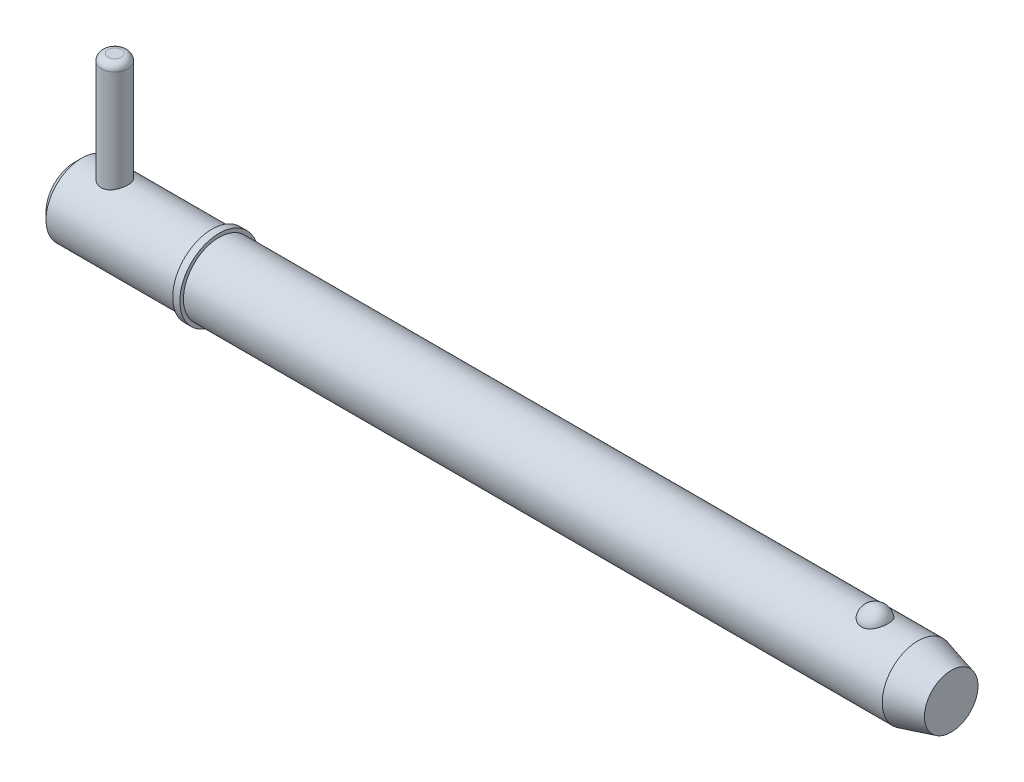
ISO-10303-21;
HEADER;
FILE_DESCRIPTION(('STEP AP214'),'2;1');
FILE_NAME('part.step','',(''),(''),'','','');
FILE_SCHEMA(('AUTOMOTIVE_DESIGN { 1 0 10303 214 1 1 1 1 }'));
ENDSEC;
DATA;
#1=APPLICATION_CONTEXT('core data for automotive mechanical design processes');
#2=APPLICATION_PROTOCOL_DEFINITION('international standard','automotive_design',2000,#1);
#3=PRODUCT_CONTEXT('',#1,'mechanical');
#4=PRODUCT('Part','Part','',(#3));
#5=PRODUCT_RELATED_PRODUCT_CATEGORY('part','',(#4));
#6=PRODUCT_DEFINITION_FORMATION('','',#4);
#7=PRODUCT_DEFINITION_CONTEXT('part definition',#1,'design');
#8=PRODUCT_DEFINITION('design','',#6,#7);
#9=PRODUCT_DEFINITION_SHAPE('','',#8);
#10=(LENGTH_UNIT() NAMED_UNIT(*) SI_UNIT(.MILLI.,.METRE.));
#11=(NAMED_UNIT(*) PLANE_ANGLE_UNIT() SI_UNIT($,.RADIAN.));
#12=(NAMED_UNIT(*) SI_UNIT($,.STERADIAN.) SOLID_ANGLE_UNIT());
#13=UNCERTAINTY_MEASURE_WITH_UNIT(LENGTH_MEASURE(1.E-05),#10,'distance_accuracy_value','');
#14=(GEOMETRIC_REPRESENTATION_CONTEXT(3) GLOBAL_UNCERTAINTY_ASSIGNED_CONTEXT((#13)) GLOBAL_UNIT_ASSIGNED_CONTEXT((#10,
#11,#12)) REPRESENTATION_CONTEXT('',''));
#15=CARTESIAN_POINT('',(0.,0.,0.));
#16=DIRECTION('',(0.,0.,1.));
#17=DIRECTION('',(1.,0.,0.));
#18=AXIS2_PLACEMENT_3D('',#15,#16,#17);
#19=CARTESIAN_POINT('',(7.14,25.4,0.));
#20=DIRECTION('',(0.,-1.,0.));
#21=DIRECTION('',(0.,0.,-1.));
#22=AXIS2_PLACEMENT_3D('',#19,#20,#21);
#23=CYLINDRICAL_SURFACE('',#22,2.38);
#24=CARTESIAN_POINT('',(7.14,-5.16,0.));
#25=DIRECTION('',(0.,1.,0.));
#26=DIRECTION('',(0.,0.,1.));
#27=AXIS2_PLACEMENT_3D('',#24,#25,#26);
#28=CIRCLE('',#27,2.38);
#29=CARTESIAN_POINT('',(7.14,-5.16,2.38));
#30=VERTEX_POINT('',#29);
#31=EDGE_CURVE('P0_E25',#30,#30,#28,.T.);
#32=ORIENTED_EDGE('',*,*,#31,.T.);
#33=EDGE_LOOP('',(#32));
#34=FACE_BOUND('',#33,.T.);
#35=CARTESIAN_POINT('',(7.14,24.21,0.));
#36=DIRECTION('',(0.,1.,0.));
#37=DIRECTION('',(0.,0.,1.));
#38=AXIS2_PLACEMENT_3D('',#35,#36,#37);
#39=CIRCLE('',#38,2.38);
#40=CARTESIAN_POINT('',(7.14,24.21,2.38));
#41=VERTEX_POINT('',#40);
#42=EDGE_CURVE('P0_E29',#41,#41,#39,.F.);
#43=ORIENTED_EDGE('',*,*,#42,.T.);
#44=EDGE_LOOP('',(#43));
#45=FACE_BOUND('',#44,.T.);
#46=ADVANCED_FACE('P0_F14',(#34,#45),#23,.T.);
#47=CARTESIAN_POINT('',(7.14,25.4,0.));
#48=DIRECTION('',(0.,1.,0.));
#49=DIRECTION('',(0.,0.,1.));
#50=AXIS2_PLACEMENT_3D('',#47,#48,#49);
#51=PLANE('',#50);
#52=CARTESIAN_POINT('',(7.14,25.4,0.));
#53=DIRECTION('',(0.,1.,0.));
#54=DIRECTION('',(0.,0.,1.));
#55=AXIS2_PLACEMENT_3D('',#52,#53,#54);
#56=CIRCLE('',#55,1.19);
#57=CARTESIAN_POINT('',(7.14,25.4,1.19));
#58=VERTEX_POINT('',#57);
#59=EDGE_CURVE('P0_E10',#58,#58,#56,.T.);
#60=ORIENTED_EDGE('',*,*,#59,.T.);
#61=EDGE_LOOP('',(#60));
#62=FACE_BOUND('',#61,.T.);
#63=ADVANCED_FACE('P0_F46',(#62),#51,.T.);
#64=CARTESIAN_POINT('',(7.14,-6.35,0.));
#65=DIRECTION('',(0.,1.,0.));
#66=DIRECTION('',(0.,0.,1.));
#67=AXIS2_PLACEMENT_3D('',#64,#65,#66);
#68=PLANE('',#67);
#69=CARTESIAN_POINT('',(7.14,-6.35,0.));
#70=DIRECTION('',(0.,1.,0.));
#71=DIRECTION('',(0.,0.,1.));
#72=AXIS2_PLACEMENT_3D('',#69,#70,#71);
#73=CIRCLE('',#72,1.19);
#74=CARTESIAN_POINT('',(7.14,-6.35,1.19));
#75=VERTEX_POINT('',#74);
#76=EDGE_CURVE('P0_E21',#75,#75,#73,.F.);
#77=ORIENTED_EDGE('',*,*,#76,.T.);
#78=EDGE_LOOP('',(#77));
#79=FACE_BOUND('',#78,.T.);
#80=ADVANCED_FACE('P0_F43',(#79),#68,.F.);
#81=CARTESIAN_POINT('',(7.14,-5.16,0.));
#82=DIRECTION('',(0.,1.,0.));
#83=DIRECTION('',(0.,0.,1.));
#84=AXIS2_PLACEMENT_3D('',#81,#82,#83);
#85=DEGENERATE_TOROIDAL_SURFACE('',#84,1.19,1.19,.T.);
#86=ORIENTED_EDGE('',*,*,#76,.F.);
#87=EDGE_LOOP('',(#86));
#88=FACE_BOUND('',#87,.T.);
#89=ORIENTED_EDGE('',*,*,#31,.F.);
#90=EDGE_LOOP('',(#89));
#91=FACE_BOUND('',#90,.T.);
#92=ADVANCED_FACE('P0_F38',(#88,#91),#85,.T.);
#93=CARTESIAN_POINT('',(7.14,24.21,0.));
#94=DIRECTION('',(0.,1.,0.));
#95=DIRECTION('',(0.,0.,1.));
#96=AXIS2_PLACEMENT_3D('',#93,#94,#95);
#97=DEGENERATE_TOROIDAL_SURFACE('',#96,1.19,1.19,.T.);
#98=ORIENTED_EDGE('',*,*,#42,.F.);
#99=EDGE_LOOP('',(#98));
#100=FACE_BOUND('',#99,.T.);
#101=ORIENTED_EDGE('',*,*,#59,.F.);
#102=EDGE_LOOP('',(#101));
#103=FACE_BOUND('',#102,.T.);
#104=ADVANCED_FACE('P0_F16',(#100,#103),#97,.T.);
#105=CLOSED_SHELL('',(#46,#63,#80,#92,#104));
#106=MANIFOLD_SOLID_BREP('P0_B1',#105);
#107=CARTESIAN_POINT('',(0.,0.,0.));
#108=DIRECTION('',(1.,0.,0.));
#109=DIRECTION('',(0.,0.,-1.));
#110=AXIS2_PLACEMENT_3D('',#107,#108,#109);
#111=CYLINDRICAL_SURFACE('',#110,6.35);
#112=CARTESIAN_POINT('',(149.955369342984,0.,0.));
#113=DIRECTION('',(1.,0.,0.));
#114=DIRECTION('',(0.,0.,-1.));
#115=AXIS2_PLACEMENT_3D('',#112,#113,#114);
#116=CIRCLE('',#115,6.35);
#117=CARTESIAN_POINT('',(149.955369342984,0.,-6.35));
#118=VERTEX_POINT('',#117);
#119=EDGE_CURVE('P1_E81',#118,#118,#116,.T.);
#120=ORIENTED_EDGE('',*,*,#119,.F.);
#121=EDGE_LOOP('',(#120));
#122=FACE_BOUND('',#121,.T.);
#123=CARTESIAN_POINT('',(25.7,0.,0.));
#124=DIRECTION('',(1.,0.,0.));
#125=DIRECTION('',(0.,0.,-1.));
#126=AXIS2_PLACEMENT_3D('',#123,#124,#125);
#127=CIRCLE('',#126,6.35);
#128=CARTESIAN_POINT('',(25.7,0.,-6.35));
#129=VERTEX_POINT('',#128);
#130=EDGE_CURVE('P1_E85',#129,#129,#127,.T.);
#131=ORIENTED_EDGE('',*,*,#130,.T.);
#132=EDGE_LOOP('',(#131));
#133=FACE_BOUND('',#132,.T.);
#134=CARTESIAN_POINT('',(142.330021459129,5.87502187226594,2.40969251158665));
#135=CARTESIAN_POINT('',(142.205030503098,5.87501645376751,2.40969773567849));
#136=CARTESIAN_POINT('',(142.080080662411,5.87916061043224,2.39967292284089));
#137=CARTESIAN_POINT('',(141.833909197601,5.89523112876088,2.35991730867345));
#138=CARTESIAN_POINT('',(141.712686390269,5.90715499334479,2.33019283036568));
#139=CARTESIAN_POINT('',(141.477517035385,5.93739567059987,2.25201402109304));
#140=CARTESIAN_POINT('',(141.363560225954,5.95570321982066,2.20358681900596));
#141=CARTESIAN_POINT('',(141.14557352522,5.99672067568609,2.08937987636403));
#142=CARTESIAN_POINT('',(141.041545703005,6.0194314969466,2.02359652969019));
#143=CARTESIAN_POINT('',(140.842943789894,6.06760647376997,1.87428969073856));
#144=CARTESIAN_POINT('',(140.748726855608,6.09313095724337,1.79031110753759));
#145=CARTESIAN_POINT('',(140.575255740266,6.14375873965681,1.6080017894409));
#146=CARTESIAN_POINT('',(140.496004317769,6.16886196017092,1.50966841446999));
#147=CARTESIAN_POINT('',(140.350845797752,6.21724600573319,1.29645884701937));
#148=CARTESIAN_POINT('',(140.285688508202,6.24039621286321,1.1810415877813));
#149=CARTESIAN_POINT('',(140.174703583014,6.28117277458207,0.940351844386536));
#150=CARTESIAN_POINT('',(140.128877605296,6.29879865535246,0.815078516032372));
#151=CARTESIAN_POINT('',(140.057023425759,6.32692073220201,0.556494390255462));
#152=CARTESIAN_POINT('',(140.031249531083,6.33732517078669,0.423102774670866));
#153=CARTESIAN_POINT('',(140.000988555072,6.34957673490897,0.153542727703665));
#154=CARTESIAN_POINT('',(139.996500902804,6.35142408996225,0.0173743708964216));
#155=CARTESIAN_POINT('',(140.008865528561,6.34638925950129,-0.253036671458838));
#156=CARTESIAN_POINT('',(140.025594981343,6.33955731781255,-0.387285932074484));
#157=CARTESIAN_POINT('',(140.079843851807,6.31794129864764,-0.650851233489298));
#158=CARTESIAN_POINT('',(140.117363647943,6.3031570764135,-0.780167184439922));
#159=CARTESIAN_POINT('',(140.212500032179,6.26711642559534,-1.03041949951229));
#160=CARTESIAN_POINT('',(140.270143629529,6.24585130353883,-1.15134433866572));
#161=CARTESIAN_POINT('',(140.404352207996,6.19905619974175,-1.38129800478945));
#162=CARTESIAN_POINT('',(140.480918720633,6.17352587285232,-1.49032586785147));
#163=CARTESIAN_POINT('',(140.651753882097,6.12080227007,-1.69393164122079));
#164=CARTESIAN_POINT('',(140.746100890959,6.09360200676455,-1.78844209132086));
#165=CARTESIAN_POINT('',(140.950119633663,6.04070434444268,-1.95970536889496));
#166=CARTESIAN_POINT('',(141.059790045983,6.015006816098,-2.0364597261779));
#167=CARTESIAN_POINT('',(141.289187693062,5.96867714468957,-2.16845644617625));
#168=CARTESIAN_POINT('',(141.408652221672,5.94794910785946,-2.22412062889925));
#169=CARTESIAN_POINT('',(141.656218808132,5.91340580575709,-2.31440992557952));
#170=CARTESIAN_POINT('',(141.784317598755,5.89958794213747,-2.34904294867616));
#171=CARTESIAN_POINT('',(142.038582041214,5.88111049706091,-2.39491590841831));
#172=CARTESIAN_POINT('',(142.164520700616,5.87602512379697,-2.40724512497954));
#173=CARTESIAN_POINT('',(142.416786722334,5.87428980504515,-2.41147867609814));
#174=CARTESIAN_POINT('',(142.543114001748,5.8776381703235,-2.40338710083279));
#175=CARTESIAN_POINT('',(142.788417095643,5.89212921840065,-2.36762715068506));
#176=CARTESIAN_POINT('',(142.907499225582,5.90302431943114,-2.3405803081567));
#177=CARTESIAN_POINT('',(143.13924472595,5.93113752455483,-2.26839066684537));
#178=CARTESIAN_POINT('',(143.251907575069,5.94835614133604,-2.22324640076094));
#179=CARTESIAN_POINT('',(143.470400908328,5.9877301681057,-2.11493806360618));
#180=CARTESIAN_POINT('',(143.576028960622,6.00998499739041,-2.05140269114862));
#181=CARTESIAN_POINT('',(143.775300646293,6.05690144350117,-1.90842705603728));
#182=CARTESIAN_POINT('',(143.868941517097,6.08156361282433,-1.82898313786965));
#183=CARTESIAN_POINT('',(144.046675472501,6.13211715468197,-1.65182429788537));
#184=CARTESIAN_POINT('',(144.130055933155,6.15800825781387,-1.5533938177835));
#185=CARTESIAN_POINT('',(144.279790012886,6.20712834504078,-1.34374214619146));
#186=CARTESIAN_POINT('',(144.346140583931,6.23035685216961,-1.23251867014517));
#187=CARTESIAN_POINT('',(144.462345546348,6.27251177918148,-0.996447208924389));
#188=CARTESIAN_POINT('',(144.511607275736,6.29127762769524,-0.871278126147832));
#189=CARTESIAN_POINT('',(144.589614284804,6.3215862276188,-0.613870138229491));
#190=CARTESIAN_POINT('',(144.618359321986,6.33312889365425,-0.481631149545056));
#191=CARTESIAN_POINT('',(144.654770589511,6.34782349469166,-0.213672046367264));
#192=CARTESIAN_POINT('',(144.662413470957,6.35096613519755,-0.0779482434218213));
#193=CARTESIAN_POINT('',(144.656395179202,6.34851322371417,0.192943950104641));
#194=CARTESIAN_POINT('',(144.642734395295,6.3429178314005,0.328112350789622));
#195=CARTESIAN_POINT('',(144.59450361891,6.32360512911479,0.593406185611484));
#196=CARTESIAN_POINT('',(144.560031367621,6.30992579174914,0.723552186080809));
#197=CARTESIAN_POINT('',(144.470953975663,6.27586325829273,0.97583417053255));
#198=CARTESIAN_POINT('',(144.41634761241,6.25547965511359,1.09796966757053));
#199=CARTESIAN_POINT('',(144.28775879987,6.20998183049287,1.33148921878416));
#200=CARTESIAN_POINT('',(144.213674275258,6.18484288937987,1.44281227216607));
#201=CARTESIAN_POINT('',(144.047820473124,6.13258735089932,1.65087683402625));
#202=CARTESIAN_POINT('',(143.956051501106,6.10547078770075,1.74761859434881));
#203=CARTESIAN_POINT('',(143.757183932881,6.05235879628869,1.92350926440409));
#204=CARTESIAN_POINT('',(143.650133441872,6.02636017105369,2.00271146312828));
#205=CARTESIAN_POINT('',(143.423138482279,5.97843747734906,2.14154159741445));
#206=CARTESIAN_POINT('',(143.303191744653,5.9565141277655,2.20116608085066));
#207=CARTESIAN_POINT('',(143.044523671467,5.91812106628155,2.30250570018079));
#208=CARTESIAN_POINT('',(142.90506980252,5.90217533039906,2.34256795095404));
#209=CARTESIAN_POINT('',(142.620397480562,5.88063128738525,2.3961521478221));
#210=CARTESIAN_POINT('',(142.47518174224,5.87502816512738,2.40968644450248));
#211=CARTESIAN_POINT('',(142.330021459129,5.87502187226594,2.40969251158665));
#212=B_SPLINE_CURVE_WITH_KNOTS('',3,(#134,#135,#136,#137,#138,#139,#140,#141,#142,#143,#144,
#145,#146,#147,#148,#149,#150,#151,#152,#153,#154,#155,#156,#157,#158,#159,#160,#161,#162,#163,
#164,#165,#166,#167,#168,#169,#170,#171,#172,#173,#174,#175,#176,#177,#178,#179,#180,#181,#182,
#183,#184,#185,#186,#187,#188,#189,#190,#191,#192,#193,#194,#195,#196,#197,#198,#199,#200,#201,
#202,#203,#204,#205,#206,#207,#208,#209,#210,#211),.UNSPECIFIED.,.T.,.F.,(4,2,2,2,2,2,2,2,2,2,2,
2,2,2,2,2,2,2,2,2,2,2,2,2,2,2,2,2,2,2,2,2,2,2,2,2,2,2,4),(0.,0.374440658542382,
0.748761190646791,1.122540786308,1.4963981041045,1.88098871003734,2.26565013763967,
2.66741104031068,3.06920639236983,3.47601794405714,3.88281858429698,4.28727498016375,
4.69173873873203,5.09674745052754,5.50178895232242,5.90865911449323,6.31549420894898,
6.71369855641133,7.11175305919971,7.48978077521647,7.86773278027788,8.23383886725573,
8.59997464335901,8.97409044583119,9.34829231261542,9.74122667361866,10.1342313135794,
10.5397522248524,10.9452779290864,11.3512521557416,11.75721896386,12.1612938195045,
12.5653932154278,12.9716540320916,13.3779078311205,13.7829098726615,14.1879832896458,
14.6230486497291,15.0579114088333),.UNSPECIFIED.);
#213=CARTESIAN_POINT('',(142.330021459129,5.87502187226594,2.40969251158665));
#214=VERTEX_POINT('',#213);
#215=EDGE_CURVE('P1_E35',#214,#214,#212,.T.);
#216=ORIENTED_EDGE('',*,*,#215,.T.);
#217=EDGE_LOOP('',(#216));
#218=FACE_BOUND('',#217,.T.);
#219=ADVANCED_FACE('P1_F13',(#122,#133,#218),#111,.T.);
#220=CARTESIAN_POINT('',(0.,0.,0.));
#221=DIRECTION('',(-1.,0.,0.));
#222=DIRECTION('',(0.,0.,1.));
#223=AXIS2_PLACEMENT_3D('',#220,#221,#222);
#224=PLANE('',#223);
#225=CARTESIAN_POINT('',(0.,0.,0.));
#226=DIRECTION('',(1.,0.,0.));
#227=DIRECTION('',(0.,0.,-1.));
#228=AXIS2_PLACEMENT_3D('',#225,#226,#227);
#229=CIRCLE('',#228,5.08);
#230=CARTESIAN_POINT('',(0.,0.,-5.08));
#231=VERTEX_POINT('',#230);
#232=EDGE_CURVE('P1_E9',#231,#231,#229,.T.);
#233=ORIENTED_EDGE('',*,*,#232,.F.);
#234=EDGE_LOOP('',(#233));
#235=FACE_BOUND('',#234,.T.);
#236=ADVANCED_FACE('P1_F15',(#235),#224,.T.);
#237=CARTESIAN_POINT('',(1.27,0.,0.));
#238=DIRECTION('',(1.,0.,0.));
#239=DIRECTION('',(0.,0.,-1.));
#240=AXIS2_PLACEMENT_3D('',#237,#238,#239);
#241=CONICAL_SURFACE('',#240,6.35,0.78539816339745);
#242=ORIENTED_EDGE('',*,*,#232,.T.);
#243=EDGE_LOOP('',(#242));
#244=FACE_BOUND('',#243,.T.);
#245=CARTESIAN_POINT('',(1.27,0.,0.));
#246=DIRECTION('',(1.,0.,0.));
#247=DIRECTION('',(0.,0.,-1.));
#248=AXIS2_PLACEMENT_3D('',#245,#246,#247);
#249=CIRCLE('',#248,6.35);
#250=CARTESIAN_POINT('',(1.27,0.,-6.35));
#251=VERTEX_POINT('',#250);
#252=EDGE_CURVE('P1_E26',#251,#251,#249,.T.);
#253=ORIENTED_EDGE('',*,*,#252,.F.);
#254=EDGE_LOOP('',(#253));
#255=FACE_BOUND('',#254,.T.);
#256=ADVANCED_FACE('P1_F77',(#244,#255),#241,.T.);
#257=CARTESIAN_POINT('',(0.,0.,0.));
#258=DIRECTION('',(1.,0.,0.));
#259=DIRECTION('',(0.,0.,-1.));
#260=AXIS2_PLACEMENT_3D('',#257,#258,#259);
#261=CYLINDRICAL_SURFACE('',#260,6.35);
#262=CARTESIAN_POINT('',(7.14,-5.88711304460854,2.38));
#263=CARTESIAN_POINT('',(7.01146258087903,-5.88710856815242,2.38000480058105));
#264=CARTESIAN_POINT('',(6.88295682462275,-5.89136840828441,2.36955244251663));
#265=CARTESIAN_POINT('',(6.62981934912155,-5.90782785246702,2.32820953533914));
#266=CARTESIAN_POINT('',(6.50518751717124,-5.92002722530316,2.29731958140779));
#267=CARTESIAN_POINT('',(6.26352403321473,-5.95079384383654,2.21639366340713));
#268=CARTESIAN_POINT('',(6.14647496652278,-5.96934583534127,2.16640353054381));
#269=CARTESIAN_POINT('',(5.92237941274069,-6.01070278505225,2.04885862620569));
#270=CARTESIAN_POINT('',(5.81533593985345,-6.03350901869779,1.98129858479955));
#271=CARTESIAN_POINT('',(5.60897525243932,-6.08207341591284,1.82693902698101));
#272=CARTESIAN_POINT('',(5.51022503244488,-6.10791836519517,1.73940861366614));
#273=CARTESIAN_POINT('',(5.32840561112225,-6.15892405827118,1.54914379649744));
#274=CARTESIAN_POINT('',(5.24533975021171,-6.1840846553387,1.44640616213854));
#275=CARTESIAN_POINT('',(5.09451639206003,-6.23191821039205,1.22434014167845));
#276=CARTESIAN_POINT('',(5.02737511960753,-6.25447755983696,1.10456656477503));
#277=CARTESIAN_POINT('',(4.91443001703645,-6.2935236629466,0.854429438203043));
#278=CARTESIAN_POINT('',(4.86861879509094,-6.31001251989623,0.724069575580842));
#279=CARTESIAN_POINT('',(4.80162253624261,-6.33444370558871,0.46242122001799));
#280=CARTESIAN_POINT('',(4.77946137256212,-6.34272370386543,0.331414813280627));
#281=CARTESIAN_POINT('',(4.75726677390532,-6.35101600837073,0.0672982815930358));
#282=CARTESIAN_POINT('',(4.75722615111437,-6.35103100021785,-0.0658111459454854));
#283=CARTESIAN_POINT('',(4.77870510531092,-6.3430064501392,-0.323358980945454));
#284=CARTESIAN_POINT('',(4.79915922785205,-6.33536494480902,-0.447900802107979));
#285=CARTESIAN_POINT('',(4.85925493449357,-6.31340794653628,-0.69163609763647));
#286=CARTESIAN_POINT('',(4.89889787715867,-6.29909198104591,-0.810829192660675));
#287=CARTESIAN_POINT('',(4.9967414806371,-6.26494471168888,-1.04254212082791));
#288=CARTESIAN_POINT('',(5.05520370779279,-6.24503620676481,-1.1549396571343));
#289=CARTESIAN_POINT('',(5.1887948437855,-6.20171869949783,-1.3686079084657));
#290=CARTESIAN_POINT('',(5.26392912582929,-6.17830856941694,-1.46987502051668));
#291=CARTESIAN_POINT('',(5.43386591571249,-6.12878580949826,-1.66468415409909));
#292=CARTESIAN_POINT('',(5.52956139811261,-6.10259519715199,-1.75742857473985));
#293=CARTESIAN_POINT('',(5.73530435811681,-6.05155777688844,-1.92585331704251));
#294=CARTESIAN_POINT('',(5.84535542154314,-6.02671130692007,-2.00152936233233));
#295=CARTESIAN_POINT('',(6.07982989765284,-5.98068420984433,-2.13519109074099));
#296=CARTESIAN_POINT('',(6.20451768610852,-5.95959698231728,-2.19274775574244));
#297=CARTESIAN_POINT('',(6.4628145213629,-5.92455622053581,-2.28574558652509));
#298=CARTESIAN_POINT('',(6.59641856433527,-5.91059872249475,-2.32119904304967));
#299=CARTESIAN_POINT('',(6.86087441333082,-5.8923327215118,-2.36717069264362));
#300=CARTESIAN_POINT('',(6.99147192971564,-5.8875347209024,-2.37895573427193));
#301=CARTESIAN_POINT('',(7.25283805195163,-5.88674545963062,-2.38091046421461));
#302=CARTESIAN_POINT('',(7.38360660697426,-5.89075200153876,-2.37108554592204));
#303=CARTESIAN_POINT('',(7.63510696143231,-5.90662331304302,-2.33124781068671));
#304=CARTESIAN_POINT('',(7.75602069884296,-5.91810660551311,-2.30221396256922));
#305=CARTESIAN_POINT('',(7.99120505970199,-5.94718527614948,-2.22601401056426));
#306=CARTESIAN_POINT('',(8.10547431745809,-5.96478190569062,-2.17884419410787));
#307=CARTESIAN_POINT('',(8.32888632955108,-6.00491533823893,-2.06572311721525));
#308=CARTESIAN_POINT('',(8.43767672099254,-6.02761250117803,-1.99913452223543));
#309=CARTESIAN_POINT('',(8.6429894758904,-6.07511988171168,-1.84974438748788));
#310=CARTESIAN_POINT('',(8.73950733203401,-6.09993087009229,-1.76693691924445));
#311=CARTESIAN_POINT('',(8.9238741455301,-6.1507686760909,-1.58125563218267));
#312=CARTESIAN_POINT('',(9.01078732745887,-6.17677301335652,-1.47744327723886));
#313=CARTESIAN_POINT('',(9.16607127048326,-6.22556172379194,-1.25606967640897));
#314=CARTESIAN_POINT('',(9.23444197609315,-6.24834608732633,-1.13850838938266));
#315=CARTESIAN_POINT('',(9.3502493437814,-6.28811144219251,-0.893050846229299));
#316=CARTESIAN_POINT('',(9.39775808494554,-6.30511236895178,-0.765192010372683));
#317=CARTESIAN_POINT('',(9.47032640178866,-6.33145833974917,-0.502514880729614));
#318=CARTESIAN_POINT('',(9.49539651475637,-6.34080697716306,-0.367699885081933));
#319=CARTESIAN_POINT('',(9.52124059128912,-6.35045496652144,-0.103396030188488));
#320=CARTESIAN_POINT('',(9.52334421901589,-6.35124952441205,0.025945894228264));
#321=CARTESIAN_POINT('',(9.50661518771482,-6.34499064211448,0.283061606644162));
#322=CARTESIAN_POINT('',(9.48778504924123,-6.33793814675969,0.410835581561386));
#323=CARTESIAN_POINT('',(9.43065630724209,-6.31700307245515,0.658028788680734));
#324=CARTESIAN_POINT('',(9.39284291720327,-6.30329098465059,0.7775756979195));
#325=CARTESIAN_POINT('',(9.29930406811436,-6.27046903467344,1.00863789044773));
#326=CARTESIAN_POINT('',(9.2435752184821,-6.25135815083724,1.12015164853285));
#327=CARTESIAN_POINT('',(9.11312349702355,-6.20865254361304,1.33711407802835));
#328=CARTESIAN_POINT('',(9.03770094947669,-6.18490316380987,1.44211105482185));
#329=CARTESIAN_POINT('',(8.87110640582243,-6.13583718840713,1.63836897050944));
#330=CARTESIAN_POINT('',(8.77992879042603,-6.11052003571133,1.72962498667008));
#331=CARTESIAN_POINT('',(8.57869799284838,-6.05953829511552,1.90076098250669));
#332=CARTESIAN_POINT('',(8.46790320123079,-6.03392573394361,1.97978778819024));
#333=CARTESIAN_POINT('',(8.23379693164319,-5.98676607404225,2.11813466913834));
#334=CARTESIAN_POINT('',(8.11048418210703,-5.9652193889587,2.17745273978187));
#335=CARTESIAN_POINT('',(7.84900037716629,-5.92818393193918,2.27641807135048));
#336=CARTESIAN_POINT('',(7.71041678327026,-5.91299857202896,2.31510015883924));
#337=CARTESIAN_POINT('',(7.42787316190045,-5.89246887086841,2.36688002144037));
#338=CARTESIAN_POINT('',(7.28391673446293,-5.88711805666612,2.37999462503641));
#339=CARTESIAN_POINT('',(7.14,-5.88711304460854,2.38));
#340=B_SPLINE_CURVE_WITH_KNOTS('',3,(#262,#263,#264,#265,#266,#267,#268,#269,#270,#271,#272,
#273,#274,#275,#276,#277,#278,#279,#280,#281,#282,#283,#284,#285,#286,#287,#288,#289,#290,#291,
#292,#293,#294,#295,#296,#297,#298,#299,#300,#301,#302,#303,#304,#305,#306,#307,#308,#309,#310,
#311,#312,#313,#314,#315,#316,#317,#318,#319,#320,#321,#322,#323,#324,#325,#326,#327,#328,#329,
#330,#331,#332,#333,#334,#335,#336,#337,#338,#339),.UNSPECIFIED.,.T.,.F.,(4,2,2,2,2,2,2,2,2,2,2,
2,2,2,2,2,2,2,2,2,2,2,2,2,2,2,2,2,2,2,2,2,2,2,2,2,2,2,4),(0.,0.385076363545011,
0.770141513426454,1.15428843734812,1.53855071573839,1.94016118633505,2.3418570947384,
2.75720522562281,3.1724093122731,3.569721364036,3.96690431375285,4.34445758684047,
4.72203759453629,5.10511017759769,5.48830640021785,5.89390240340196,6.29959991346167,
6.71428455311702,7.12873839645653,7.52034494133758,7.91185376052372,8.28480528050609,
8.65783318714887,9.0448340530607,9.43197664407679,9.84363087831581,10.2552863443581,
10.6655081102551,11.0755371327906,11.4616919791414,11.847800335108,12.224507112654,
12.6012852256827,12.9938941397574,13.386643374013,13.8000944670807,14.2135876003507,
14.6450218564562,15.0761720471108),.UNSPECIFIED.);
#341=CARTESIAN_POINT('',(7.14,-5.88711304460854,2.38));
#342=VERTEX_POINT('',#341);
#343=EDGE_CURVE('P1_E17',#342,#342,#340,.T.);
#344=ORIENTED_EDGE('',*,*,#343,.F.);
#345=EDGE_LOOP('',(#344));
#346=FACE_BOUND('',#345,.T.);
#347=CARTESIAN_POINT('',(7.14,5.88711304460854,2.38));
#348=CARTESIAN_POINT('',(7.26853741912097,5.88710856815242,2.38000480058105));
#349=CARTESIAN_POINT('',(7.39704317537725,5.89136840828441,2.36955244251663));
#350=CARTESIAN_POINT('',(7.65018065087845,5.90782785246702,2.32820953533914));
#351=CARTESIAN_POINT('',(7.77481248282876,5.92002722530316,2.29731958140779));
#352=CARTESIAN_POINT('',(8.01647596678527,5.95079384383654,2.21639366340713));
#353=CARTESIAN_POINT('',(8.13352503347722,5.96934583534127,2.16640353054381));
#354=CARTESIAN_POINT('',(8.35762058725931,6.01070278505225,2.04885862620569));
#355=CARTESIAN_POINT('',(8.46466406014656,6.03350901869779,1.98129858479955));
#356=CARTESIAN_POINT('',(8.67102474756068,6.08207341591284,1.82693902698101));
#357=CARTESIAN_POINT('',(8.76977496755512,6.10791836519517,1.73940861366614));
#358=CARTESIAN_POINT('',(8.95159438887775,6.15892405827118,1.54914379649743));
#359=CARTESIAN_POINT('',(9.03466024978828,6.1840846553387,1.44640616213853));
#360=CARTESIAN_POINT('',(9.18548360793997,6.23191821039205,1.22434014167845));
#361=CARTESIAN_POINT('',(9.25262488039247,6.25447755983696,1.10456656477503));
#362=CARTESIAN_POINT('',(9.36556998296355,6.2935236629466,0.854429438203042));
#363=CARTESIAN_POINT('',(9.41138120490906,6.31001251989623,0.72406957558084));
#364=CARTESIAN_POINT('',(9.47837746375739,6.33444370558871,0.462421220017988));
#365=CARTESIAN_POINT('',(9.50053862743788,6.34272370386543,0.331414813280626));
#366=CARTESIAN_POINT('',(9.52273322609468,6.35101600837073,0.0672982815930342));
#367=CARTESIAN_POINT('',(9.52277384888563,6.35103100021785,-0.0658111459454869));
#368=CARTESIAN_POINT('',(9.50129489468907,6.3430064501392,-0.323358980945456));
#369=CARTESIAN_POINT('',(9.48084077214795,6.33536494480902,-0.447900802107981));
#370=CARTESIAN_POINT('',(9.42074506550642,6.31340794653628,-0.691636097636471));
#371=CARTESIAN_POINT('',(9.38110212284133,6.29909198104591,-0.810829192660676));
#372=CARTESIAN_POINT('',(9.2832585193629,6.26494471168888,-1.04254212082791));
#373=CARTESIAN_POINT('',(9.22479629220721,6.24503620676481,-1.1549396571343));
#374=CARTESIAN_POINT('',(9.0912051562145,6.20171869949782,-1.3686079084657));
#375=CARTESIAN_POINT('',(9.0160708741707,6.17830856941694,-1.46987502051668));
#376=CARTESIAN_POINT('',(8.84613408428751,6.12878580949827,-1.66468415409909));
#377=CARTESIAN_POINT('',(8.75043860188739,6.10259519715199,-1.75742857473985));
#378=CARTESIAN_POINT('',(8.54469564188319,6.05155777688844,-1.92585331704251));
#379=CARTESIAN_POINT('',(8.43464457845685,6.02671130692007,-2.00152936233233));
#380=CARTESIAN_POINT('',(8.20017010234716,5.98068420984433,-2.13519109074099));
#381=CARTESIAN_POINT('',(8.07548231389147,5.95959698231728,-2.19274775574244));
#382=CARTESIAN_POINT('',(7.8171854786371,5.9245562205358,-2.28574558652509));
#383=CARTESIAN_POINT('',(7.68358143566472,5.91059872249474,-2.32119904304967));
#384=CARTESIAN_POINT('',(7.41912558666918,5.8923327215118,-2.36717069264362));
#385=CARTESIAN_POINT('',(7.28852807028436,5.8875347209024,-2.37895573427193));
#386=CARTESIAN_POINT('',(7.02716194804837,5.88674545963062,-2.38091046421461));
#387=CARTESIAN_POINT('',(6.89639339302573,5.89075200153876,-2.37108554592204));
#388=CARTESIAN_POINT('',(6.64489303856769,5.90662331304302,-2.33124781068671));
#389=CARTESIAN_POINT('',(6.52397930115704,5.91810660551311,-2.30221396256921));
#390=CARTESIAN_POINT('',(6.288794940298,5.94718527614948,-2.22601401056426));
#391=CARTESIAN_POINT('',(6.17452568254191,5.96478190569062,-2.17884419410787));
#392=CARTESIAN_POINT('',(5.95111367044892,6.00491533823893,-2.06572311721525));
#393=CARTESIAN_POINT('',(5.84232327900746,6.02761250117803,-1.99913452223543));
#394=CARTESIAN_POINT('',(5.6370105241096,6.07511988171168,-1.84974438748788));
#395=CARTESIAN_POINT('',(5.54049266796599,6.09993087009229,-1.76693691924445));
#396=CARTESIAN_POINT('',(5.3561258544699,6.1507686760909,-1.58125563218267));
#397=CARTESIAN_POINT('',(5.26921267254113,6.17677301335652,-1.47744327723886));
#398=CARTESIAN_POINT('',(5.11392872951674,6.22556172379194,-1.25606967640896));
#399=CARTESIAN_POINT('',(5.04555802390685,6.24834608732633,-1.13850838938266));
#400=CARTESIAN_POINT('',(4.9297506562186,6.28811144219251,-0.893050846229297));
#401=CARTESIAN_POINT('',(4.88224191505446,6.30511236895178,-0.76519201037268));
#402=CARTESIAN_POINT('',(4.80967359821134,6.33145833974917,-0.502514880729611));
#403=CARTESIAN_POINT('',(4.78460348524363,6.34080697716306,-0.36769988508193));
#404=CARTESIAN_POINT('',(4.75875940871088,6.35045496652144,-0.103396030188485));
#405=CARTESIAN_POINT('',(4.75665578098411,6.35124952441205,0.025945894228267));
#406=CARTESIAN_POINT('',(4.77338481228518,6.34499064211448,0.283061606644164));
#407=CARTESIAN_POINT('',(4.79221495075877,6.33793814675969,0.410835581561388));
#408=CARTESIAN_POINT('',(4.84934369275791,6.31700307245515,0.658028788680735));
#409=CARTESIAN_POINT('',(4.88715708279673,6.30329098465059,0.777575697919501));
#410=CARTESIAN_POINT('',(4.98069593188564,6.27046903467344,1.00863789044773));
#411=CARTESIAN_POINT('',(5.0364247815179,6.25135815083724,1.12015164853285));
#412=CARTESIAN_POINT('',(5.16687650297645,6.20865254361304,1.33711407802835));
#413=CARTESIAN_POINT('',(5.24229905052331,6.18490316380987,1.44211105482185));
#414=CARTESIAN_POINT('',(5.40889359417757,6.13583718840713,1.63836897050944));
#415=CARTESIAN_POINT('',(5.50007120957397,6.11052003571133,1.72962498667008));
#416=CARTESIAN_POINT('',(5.70130200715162,6.05953829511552,1.90076098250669));
#417=CARTESIAN_POINT('',(5.81209679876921,6.03392573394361,1.97978778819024));
#418=CARTESIAN_POINT('',(6.04620306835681,5.98676607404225,2.11813466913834));
#419=CARTESIAN_POINT('',(6.16951581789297,5.9652193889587,2.17745273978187));
#420=CARTESIAN_POINT('',(6.43099962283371,5.92818393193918,2.27641807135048));
#421=CARTESIAN_POINT('',(6.56958321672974,5.91299857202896,2.31510015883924));
#422=CARTESIAN_POINT('',(6.85212683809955,5.89246887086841,2.36688002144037));
#423=CARTESIAN_POINT('',(6.99608326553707,5.88711805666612,2.37999462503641));
#424=CARTESIAN_POINT('',(7.14,5.88711304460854,2.38));
#425=B_SPLINE_CURVE_WITH_KNOTS('',3,(#347,#348,#349,#350,#351,#352,#353,#354,#355,#356,#357,
#358,#359,#360,#361,#362,#363,#364,#365,#366,#367,#368,#369,#370,#371,#372,#373,#374,#375,#376,
#377,#378,#379,#380,#381,#382,#383,#384,#385,#386,#387,#388,#389,#390,#391,#392,#393,#394,#395,
#396,#397,#398,#399,#400,#401,#402,#403,#404,#405,#406,#407,#408,#409,#410,#411,#412,#413,#414,
#415,#416,#417,#418,#419,#420,#421,#422,#423,#424),.UNSPECIFIED.,.T.,.F.,(4,2,2,2,2,2,2,2,2,2,2,
2,2,2,2,2,2,2,2,2,2,2,2,2,2,2,2,2,2,2,2,2,2,2,2,2,2,2,4),(0.,0.385076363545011,
0.770141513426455,1.15428843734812,1.53855071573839,1.94016118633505,2.3418570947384,
2.75720522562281,3.1724093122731,3.56972136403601,3.96690431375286,4.34445758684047,
4.72203759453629,5.10511017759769,5.48830640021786,5.89390240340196,6.29959991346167,
6.71428455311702,7.12873839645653,7.52034494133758,7.91185376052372,8.2848052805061,
8.65783318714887,9.0448340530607,9.43197664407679,9.84363087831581,10.2552863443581,
10.6655081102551,11.0755371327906,11.4616919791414,11.847800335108,12.2245071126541,
12.6012852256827,12.9938941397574,13.386643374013,13.8000944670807,14.2135876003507,
14.6450218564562,15.0761720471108),.UNSPECIFIED.);
#426=CARTESIAN_POINT('',(7.14,5.88711304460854,2.38));
#427=VERTEX_POINT('',#426);
#428=EDGE_CURVE('P1_E43',#427,#427,#425,.T.);
#429=ORIENTED_EDGE('',*,*,#428,.F.);
#430=EDGE_LOOP('',(#429));
#431=FACE_BOUND('',#430,.T.);
#432=ORIENTED_EDGE('',*,*,#252,.T.);
#433=EDGE_LOOP('',(#432));
#434=FACE_BOUND('',#433,.T.);
#435=CARTESIAN_POINT('',(24.43,0.,0.));
#436=DIRECTION('',(1.,0.,0.));
#437=DIRECTION('',(0.,0.,-1.));
#438=AXIS2_PLACEMENT_3D('',#435,#436,#437);
#439=CIRCLE('',#438,6.35);
#440=CARTESIAN_POINT('',(24.43,0.,-6.35));
#441=VERTEX_POINT('',#440);
#442=EDGE_CURVE('P1_E31',#441,#441,#439,.T.);
#443=ORIENTED_EDGE('',*,*,#442,.F.);
#444=EDGE_LOOP('',(#443));
#445=FACE_BOUND('',#444,.T.);
#446=ADVANCED_FACE('P1_F103',(#346,#431,#434,#445),#261,.T.);
#447=CARTESIAN_POINT('',(24.43,6.35,0.));
#448=DIRECTION('',(-1.,0.,0.));
#449=DIRECTION('',(0.,0.,1.));
#450=AXIS2_PLACEMENT_3D('',#447,#448,#449);
#451=PLANE('',#450);
#452=ORIENTED_EDGE('',*,*,#442,.T.);
#453=EDGE_LOOP('',(#452));
#454=FACE_BOUND('',#453,.T.);
#455=CARTESIAN_POINT('',(24.43,0.,0.));
#456=DIRECTION('',(1.,0.,0.));
#457=DIRECTION('',(0.,0.,-1.));
#458=AXIS2_PLACEMENT_3D('',#455,#456,#457);
#459=CIRCLE('',#458,6.985);
#460=CARTESIAN_POINT('',(24.43,0.,-6.985));
#461=VERTEX_POINT('',#460);
#462=EDGE_CURVE('P1_E91',#461,#461,#459,.T.);
#463=ORIENTED_EDGE('',*,*,#462,.F.);
#464=EDGE_LOOP('',(#463));
#465=FACE_BOUND('',#464,.T.);
#466=ADVANCED_FACE('P1_F100',(#454,#465),#451,.T.);
#467=CARTESIAN_POINT('',(0.,0.,0.));
#468=DIRECTION('',(1.,0.,0.));
#469=DIRECTION('',(0.,0.,-1.));
#470=AXIS2_PLACEMENT_3D('',#467,#468,#469);
#471=CYLINDRICAL_SURFACE('',#470,6.985);
#472=ORIENTED_EDGE('',*,*,#462,.T.);
#473=EDGE_LOOP('',(#472));
#474=FACE_BOUND('',#473,.T.);
#475=CARTESIAN_POINT('',(25.7,0.,0.));
#476=DIRECTION('',(1.,0.,0.));
#477=DIRECTION('',(0.,0.,-1.));
#478=AXIS2_PLACEMENT_3D('',#475,#476,#477);
#479=CIRCLE('',#478,6.985);
#480=CARTESIAN_POINT('',(25.7,0.,-6.985));
#481=VERTEX_POINT('',#480);
#482=EDGE_CURVE('P1_E88',#481,#481,#479,.T.);
#483=ORIENTED_EDGE('',*,*,#482,.F.);
#484=EDGE_LOOP('',(#483));
#485=FACE_BOUND('',#484,.T.);
#486=ADVANCED_FACE('P1_F68',(#474,#485),#471,.T.);
#487=CARTESIAN_POINT('',(25.7,6.985,0.));
#488=DIRECTION('',(1.,0.,0.));
#489=DIRECTION('',(0.,0.,-1.));
#490=AXIS2_PLACEMENT_3D('',#487,#488,#489);
#491=PLANE('',#490);
#492=ORIENTED_EDGE('',*,*,#482,.T.);
#493=EDGE_LOOP('',(#492));
#494=FACE_BOUND('',#493,.T.);
#495=ORIENTED_EDGE('',*,*,#130,.F.);
#496=EDGE_LOOP('',(#495));
#497=FACE_BOUND('',#496,.T.);
#498=ADVANCED_FACE('P1_F62',(#494,#497),#491,.T.);
#499=CARTESIAN_POINT('',(155.88,0.,0.));
#500=DIRECTION('',(-1.,0.,0.));
#501=DIRECTION('',(0.,0.,1.));
#502=AXIS2_PLACEMENT_3D('',#499,#500,#501);
#503=CONICAL_SURFACE('',#502,4.76250000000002,0.26179938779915);
#504=ORIENTED_EDGE('',*,*,#119,.T.);
#505=EDGE_LOOP('',(#504));
#506=FACE_BOUND('',#505,.T.);
#507=CARTESIAN_POINT('',(155.88,0.,0.));
#508=DIRECTION('',(1.,0.,0.));
#509=DIRECTION('',(0.,0.,-1.));
#510=AXIS2_PLACEMENT_3D('',#507,#508,#509);
#511=CIRCLE('',#510,4.76250000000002);
#512=CARTESIAN_POINT('',(155.88,0.,-4.76250000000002));
#513=VERTEX_POINT('',#512);
#514=EDGE_CURVE('P1_E42',#513,#513,#511,.T.);
#515=ORIENTED_EDGE('',*,*,#514,.F.);
#516=EDGE_LOOP('',(#515));
#517=FACE_BOUND('',#516,.T.);
#518=ADVANCED_FACE('P1_F59',(#506,#517),#503,.T.);
#519=CARTESIAN_POINT('',(155.88,4.76250000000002,0.));
#520=DIRECTION('',(1.,0.,0.));
#521=DIRECTION('',(0.,0.,-1.));
#522=AXIS2_PLACEMENT_3D('',#519,#520,#521);
#523=PLANE('',#522);
#524=ORIENTED_EDGE('',*,*,#514,.T.);
#525=EDGE_LOOP('',(#524));
#526=FACE_BOUND('',#525,.T.);
#527=ADVANCED_FACE('P1_F55',(#526),#523,.T.);
#528=CARTESIAN_POINT('',(142.330021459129,5.715,0.));
#529=DIRECTION('',(-1.,0.,0.));
#530=DIRECTION('',(0.,1.,0.));
#531=AXIS2_PLACEMENT_3D('',#528,#529,#530);
#532=SPHERICAL_SURFACE('',#531,2.41500000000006);
#533=ORIENTED_EDGE('',*,*,#215,.F.);
#534=EDGE_LOOP('',(#533));
#535=FACE_BOUND('',#534,.T.);
#536=ADVANCED_FACE('P1_F50',(#535),#532,.T.);
#537=CARTESIAN_POINT('',(7.14,-6.985,0.));
#538=DIRECTION('',(0.,1.,0.));
#539=DIRECTION('',(0.,0.,1.));
#540=AXIS2_PLACEMENT_3D('',#537,#538,#539);
#541=CYLINDRICAL_SURFACE('',#540,2.38);
#542=ORIENTED_EDGE('',*,*,#343,.T.);
#543=EDGE_LOOP('',(#542));
#544=FACE_BOUND('',#543,.T.);
#545=ORIENTED_EDGE('',*,*,#428,.T.);
#546=EDGE_LOOP('',(#545));
#547=FACE_BOUND('',#546,.T.);
#548=ADVANCED_FACE('P1_F54',(#544,#547),#541,.F.);
#549=CLOSED_SHELL('',(#219,#236,#256,#446,#466,#486,#498,#518,#527,#536,#548));
#550=MANIFOLD_SOLID_BREP('P1_B1',#549);
#551=ADVANCED_BREP_SHAPE_REPRESENTATION('',(#18,#106,#550),#14);
#552=SHAPE_DEFINITION_REPRESENTATION(#9,#551);
ENDSEC;
END-ISO-10303-21;
